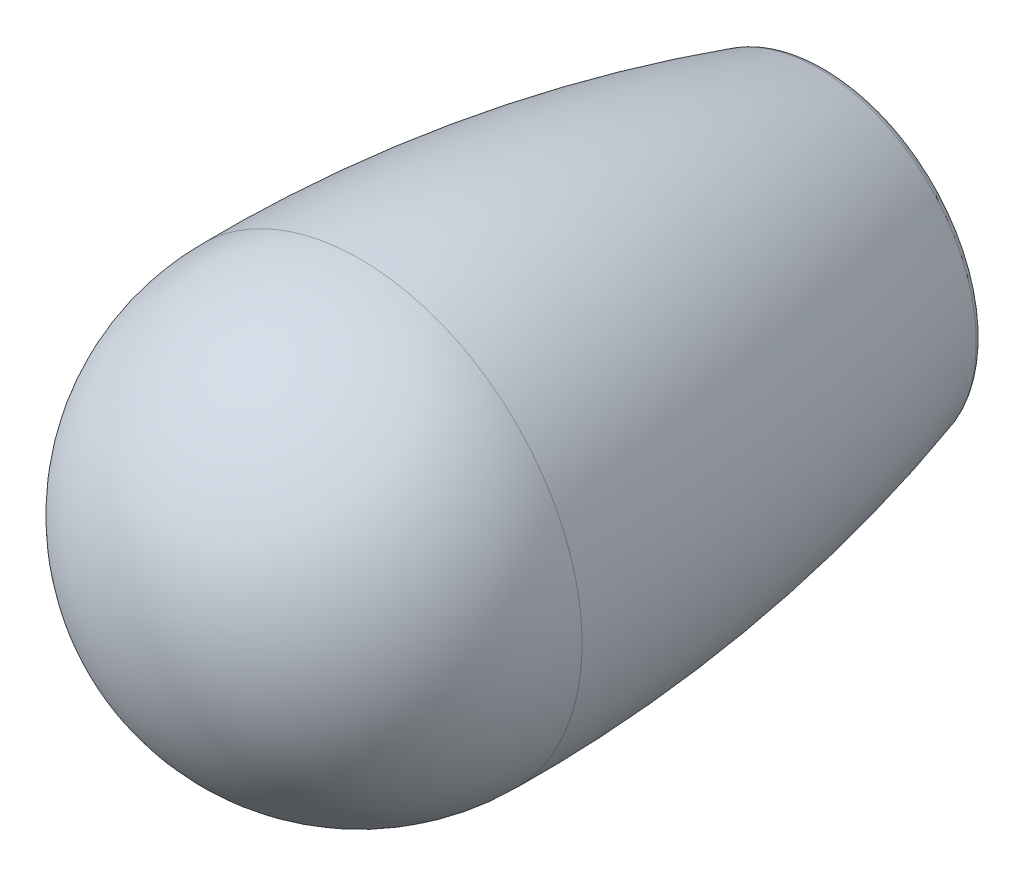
ISO-10303-21;
HEADER;
FILE_DESCRIPTION(('STEP AP214'),'2;1');
FILE_NAME('part.step','',(''),(''),'','','');
FILE_SCHEMA(('AUTOMOTIVE_DESIGN { 1 0 10303 214 1 1 1 1 }'));
ENDSEC;
DATA;
#1=APPLICATION_CONTEXT('core data for automotive mechanical design processes');
#2=APPLICATION_PROTOCOL_DEFINITION('international standard','automotive_design',2000,#1);
#3=PRODUCT_CONTEXT('',#1,'mechanical');
#4=PRODUCT('Part','Part','',(#3));
#5=PRODUCT_RELATED_PRODUCT_CATEGORY('part','',(#4));
#6=PRODUCT_DEFINITION_FORMATION('','',#4);
#7=PRODUCT_DEFINITION_CONTEXT('part definition',#1,'design');
#8=PRODUCT_DEFINITION('design','',#6,#7);
#9=PRODUCT_DEFINITION_SHAPE('','',#8);
#10=(LENGTH_UNIT() NAMED_UNIT(*) SI_UNIT(.MILLI.,.METRE.));
#11=(NAMED_UNIT(*) PLANE_ANGLE_UNIT() SI_UNIT($,.RADIAN.));
#12=(NAMED_UNIT(*) SI_UNIT($,.STERADIAN.) SOLID_ANGLE_UNIT());
#13=UNCERTAINTY_MEASURE_WITH_UNIT(LENGTH_MEASURE(1.E-05),#10,'distance_accuracy_value','');
#14=(GEOMETRIC_REPRESENTATION_CONTEXT(3) GLOBAL_UNCERTAINTY_ASSIGNED_CONTEXT((#13)) GLOBAL_UNIT_ASSIGNED_CONTEXT((#10,
#11,#12)) REPRESENTATION_CONTEXT('',''));
#15=CARTESIAN_POINT('',(0.,0.,0.));
#16=DIRECTION('',(0.,0.,1.));
#17=DIRECTION('',(1.,0.,0.));
#18=AXIS2_PLACEMENT_3D('',#15,#16,#17);
#19=CARTESIAN_POINT('',(0.,0.,21.));
#20=DIRECTION('',(-1.,0.,0.));
#21=DIRECTION('',(0.,0.,1.));
#22=AXIS2_PLACEMENT_3D('',#19,#20,#21);
#23=SPHERICAL_SURFACE('',#22,10.);
#24=CARTESIAN_POINT('',(0.,0.,21.));
#25=DIRECTION('',(0.,0.,-1.));
#26=DIRECTION('',(-1.,0.,0.));
#27=AXIS2_PLACEMENT_3D('',#24,#25,#26);
#28=SPHERICAL_SURFACE('',#27,10.);
#29=CARTESIAN_POINT('',(0.,0.,21.));
#30=DIRECTION('',(0.,0.,-1.));
#31=DIRECTION('',(-1.,0.,0.));
#32=AXIS2_PLACEMENT_3D('',#29,#30,#31);
#33=CIRCLE('',#32,10.);
#34=CARTESIAN_POINT('',(-10.,0.,21.));
#35=VERTEX_POINT('',#34);
#36=EDGE_CURVE('E8',#35,#35,#33,.T.);
#37=ORIENTED_EDGE('',*,*,#36,.F.);
#38=EDGE_LOOP('',(#37));
#39=FACE_BOUND('',#38,.T.);
#40=ADVANCED_FACE('F12',(#39),#28,.T.);
#41=CARTESIAN_POINT('',(0.,0.,20.2851928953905));
#42=DIRECTION('',(0.,0.,-1.));
#43=DIRECTION('',(-1.,0.,0.));
#44=AXIS2_PLACEMENT_3D('',#41,#42,#43);
#45=DEGENERATE_TOROIDAL_SURFACE('',#44,59.9963502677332,70.,.F.);
#46=CARTESIAN_POINT('',(0.,0.,0.357660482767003));
#47=DIRECTION('',(0.,0.,-1.));
#48=DIRECTION('',(-1.,0.,0.));
#49=AXIS2_PLACEMENT_3D('',#46,#47,#48);
#50=CIRCLE('',#49,7.10725210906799);
#51=CARTESIAN_POINT('',(-7.10725210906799,0.,0.357660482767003));
#52=VERTEX_POINT('',#51);
#53=EDGE_CURVE('E19',#52,#52,#50,.T.);
#54=ORIENTED_EDGE('',*,*,#53,.F.);
#55=EDGE_LOOP('',(#54));
#56=FACE_BOUND('',#55,.T.);
#57=ORIENTED_EDGE('',*,*,#36,.T.);
#58=EDGE_LOOP('',(#57));
#59=FACE_BOUND('',#58,.T.);
#60=ADVANCED_FACE('F65',(#56,#59),#45,.F.);
#61=CARTESIAN_POINT('',(0.,0.,0.5));
#62=DIRECTION('',(0.,0.,-1.));
#63=DIRECTION('',(-1.,0.,0.));
#64=AXIS2_PLACEMENT_3D('',#61,#62,#63);
#65=TOROIDAL_SURFACE('',#64,6.62794066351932,0.50000000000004);
#66=CARTESIAN_POINT('',(0.,0.,0.));
#67=DIRECTION('',(0.,0.,-1.));
#68=DIRECTION('',(-1.,0.,0.));
#69=AXIS2_PLACEMENT_3D('',#66,#67,#68);
#70=CIRCLE('',#69,6.62794066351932);
#71=CARTESIAN_POINT('',(-6.62794066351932,0.,0.));
#72=VERTEX_POINT('',#71);
#73=EDGE_CURVE('E23',#72,#72,#70,.T.);
#74=ORIENTED_EDGE('',*,*,#73,.F.);
#75=EDGE_LOOP('',(#74));
#76=FACE_BOUND('',#75,.T.);
#77=ORIENTED_EDGE('',*,*,#53,.T.);
#78=EDGE_LOOP('',(#77));
#79=FACE_BOUND('',#78,.T.);
#80=ADVANCED_FACE('F59',(#76,#79),#65,.T.);
#81=CARTESIAN_POINT('',(0.,6.62794066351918,0.));
#82=DIRECTION('',(0.,0.,1.));
#83=DIRECTION('',(1.,0.,0.));
#84=AXIS2_PLACEMENT_3D('',#81,#82,#83);
#85=PLANE('',#84);
#86=CARTESIAN_POINT('',(0.,0.,0.));
#87=DIRECTION('',(0.,0.,-1.));
#88=DIRECTION('',(-1.,0.,0.));
#89=AXIS2_PLACEMENT_3D('',#86,#87,#88);
#90=CIRCLE('',#89,4.);
#91=CARTESIAN_POINT('',(-4.,0.,0.));
#92=VERTEX_POINT('',#91);
#93=EDGE_CURVE('E31',#92,#92,#90,.T.);
#94=ORIENTED_EDGE('',*,*,#93,.F.);
#95=EDGE_LOOP('',(#94));
#96=FACE_BOUND('',#95,.T.);
#97=ORIENTED_EDGE('',*,*,#73,.T.);
#98=EDGE_LOOP('',(#97));
#99=FACE_BOUND('',#98,.T.);
#100=ADVANCED_FACE('F53',(#96,#99),#85,.F.);
#101=CARTESIAN_POINT('',(0.,0.,21.));
#102=DIRECTION('',(0.,0.,-1.));
#103=DIRECTION('',(-1.,0.,0.));
#104=AXIS2_PLACEMENT_3D('',#101,#102,#103);
#105=CYLINDRICAL_SURFACE('',#104,4.);
#106=CARTESIAN_POINT('',(0.,0.,21.));
#107=DIRECTION('',(0.,0.,-1.));
#108=DIRECTION('',(-1.,0.,0.));
#109=AXIS2_PLACEMENT_3D('',#106,#107,#108);
#110=CIRCLE('',#109,4.);
#111=CARTESIAN_POINT('',(-4.,0.,21.));
#112=VERTEX_POINT('',#111);
#113=EDGE_CURVE('E28',#112,#112,#110,.T.);
#114=ORIENTED_EDGE('',*,*,#113,.F.);
#115=EDGE_LOOP('',(#114));
#116=FACE_BOUND('',#115,.T.);
#117=ORIENTED_EDGE('',*,*,#93,.T.);
#118=EDGE_LOOP('',(#117));
#119=FACE_BOUND('',#118,.T.);
#120=ADVANCED_FACE('F47',(#116,#119),#105,.F.);
#121=CARTESIAN_POINT('',(0.,0.,21.));
#122=DIRECTION('',(0.,0.,-1.));
#123=DIRECTION('',(-1.,0.,0.));
#124=AXIS2_PLACEMENT_3D('',#121,#122,#123);
#125=PLANE('',#124);
#126=CARTESIAN_POINT('',(0.,0.,21.));
#127=DIRECTION('',(0.,0.,-1.));
#128=DIRECTION('',(-1.,0.,0.));
#129=AXIS2_PLACEMENT_3D('',#126,#127,#128);
#130=CIRCLE('',#129,3.);
#131=CARTESIAN_POINT('',(-3.,0.,21.));
#132=VERTEX_POINT('',#131);
#133=EDGE_CURVE('E15',#132,#132,#130,.T.);
#134=ORIENTED_EDGE('',*,*,#133,.F.);
#135=EDGE_LOOP('',(#134));
#136=FACE_BOUND('',#135,.T.);
#137=ORIENTED_EDGE('',*,*,#113,.T.);
#138=EDGE_LOOP('',(#137));
#139=FACE_BOUND('',#138,.T.);
#140=ADVANCED_FACE('F44',(#136,#139),#125,.T.);
#141=CARTESIAN_POINT('',(0.,0.,28.));
#142=DIRECTION('',(0.,0.,-1.));
#143=DIRECTION('',(-1.,0.,0.));
#144=AXIS2_PLACEMENT_3D('',#141,#142,#143);
#145=CYLINDRICAL_SURFACE('',#144,3.);
#146=ORIENTED_EDGE('',*,*,#133,.T.);
#147=EDGE_LOOP('',(#146));
#148=FACE_BOUND('',#147,.T.);
#149=CARTESIAN_POINT('',(0.,0.,28.));
#150=DIRECTION('',(0.,0.,-1.));
#151=DIRECTION('',(-1.,0.,0.));
#152=AXIS2_PLACEMENT_3D('',#149,#150,#151);
#153=CIRCLE('',#152,3.);
#154=CARTESIAN_POINT('',(-3.,0.,28.));
#155=VERTEX_POINT('',#154);
#156=EDGE_CURVE('E34',#155,#155,#153,.T.);
#157=ORIENTED_EDGE('',*,*,#156,.F.);
#158=EDGE_LOOP('',(#157));
#159=FACE_BOUND('',#158,.T.);
#160=ADVANCED_FACE('F41',(#148,#159),#145,.F.);
#161=CARTESIAN_POINT('',(0.,0.,28.));
#162=DIRECTION('',(0.,0.,-1.));
#163=DIRECTION('',(-1.,0.,0.));
#164=AXIS2_PLACEMENT_3D('',#161,#162,#163);
#165=PLANE('',#164);
#166=ORIENTED_EDGE('',*,*,#156,.T.);
#167=EDGE_LOOP('',(#166));
#168=FACE_BOUND('',#167,.T.);
#169=ADVANCED_FACE('F79',(#168),#165,.T.);
#170=CLOSED_SHELL('',(#40,#60,#80,#100,#120,#140,#160,#169));
#171=MANIFOLD_SOLID_BREP('B1',#170);
#172=ADVANCED_BREP_SHAPE_REPRESENTATION('',(#18,#171),#14);
#173=SHAPE_DEFINITION_REPRESENTATION(#9,#172);
ENDSEC;
END-ISO-10303-21;
